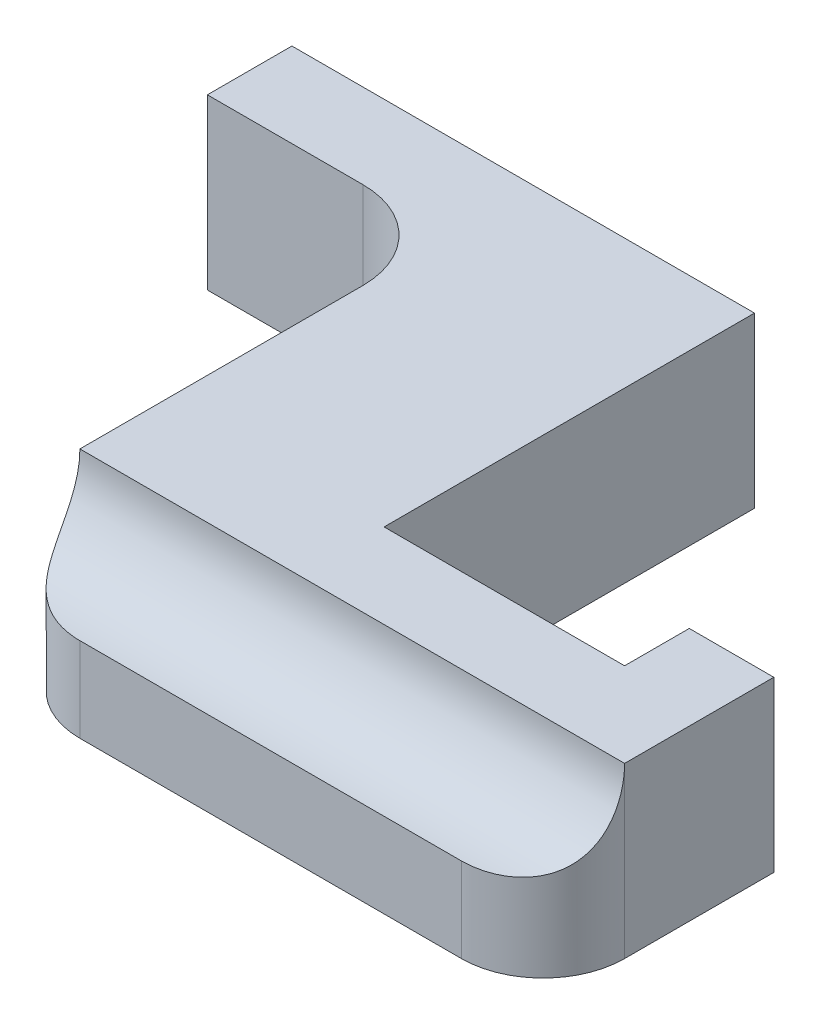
from build123d import *

# Parameters (mm, degrees)
BOSS_EXTRUDE1_DEPTH = 10.16
CUT_EXTRUDE1_DEPTH  = 62.02955241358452


with BuildPart() as part:
    # Sketch1 → Boss-Extrude1 (new body)
    with BuildSketch(Plane(origin=(0, 0, 0), x_dir=(1, 0, 0), z_dir=(0, 1, 0))):
        with BuildLine():
            Line((22.42716000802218, -10.002932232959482), (31.767238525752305, -10.002932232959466))
            ThreePointArc((31.767238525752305, -10.002932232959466), (35.485064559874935, -11.542906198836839), (37.025038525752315, -15.26073223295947))
            Line((37.025038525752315, -15.26073223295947), (37.02503852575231, -32.262004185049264))
            ThreePointArc((37.02503852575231, -32.262004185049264), (38.46085966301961, -35.72838304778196), (41.92723852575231, -37.16420418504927))
            Line((41.92723852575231, -37.16420418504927), (64.85573852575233, -37.16420418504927))
            ThreePointArc((64.85573852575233, -37.16420418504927), (68.32211738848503, -35.72838304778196), (69.75793852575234, -32.262004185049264))
            Line((69.75793852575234, -32.262004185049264), (69.75793852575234, -23.295804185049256))
            Line((69.75793852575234, -23.295804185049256), (64.67793852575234, -23.295804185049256))
            Line((64.67793852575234, -23.295804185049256), (64.67793852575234, -27.182004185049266))
            Line((64.67793852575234, -27.182004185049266), (50.22533852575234, -27.182004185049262))
            Line((50.22533852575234, -27.182004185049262), (50.22533852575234, -4.922932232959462))
            Line((50.22533852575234, -4.922932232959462), (22.42716000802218, -4.9229322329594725))
            Line((22.42716000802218, -4.9229322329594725), (22.42716000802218, -10.002932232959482))
        make_face()
    extrude(amount=-BOSS_EXTRUDE1_DEPTH)

    # Sketch2 → Cut-Extrude1 (cut, through all)
    with BuildSketch(Plane(origin=(69.75793852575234, 0, 0), x_dir=(0, 0, -1), z_dir=(1, 0, 0))):
        with BuildLine():
            Line((-37.16420418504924, -5.076887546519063), (-37.342004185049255, -4.051e-14))
            Line((-37.342004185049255, -4.051e-14), (-32.26200418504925, -5.015e-14))
            ThreePointArc((-32.26200418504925, -5.015e-14), (-33.687580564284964, -3.5286807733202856), (-37.16420418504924, -5.076887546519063))
        make_face()
    extrude(amount=-CUT_EXTRUDE1_DEPTH, mode=Mode.SUBTRACT)


solid = part.part
